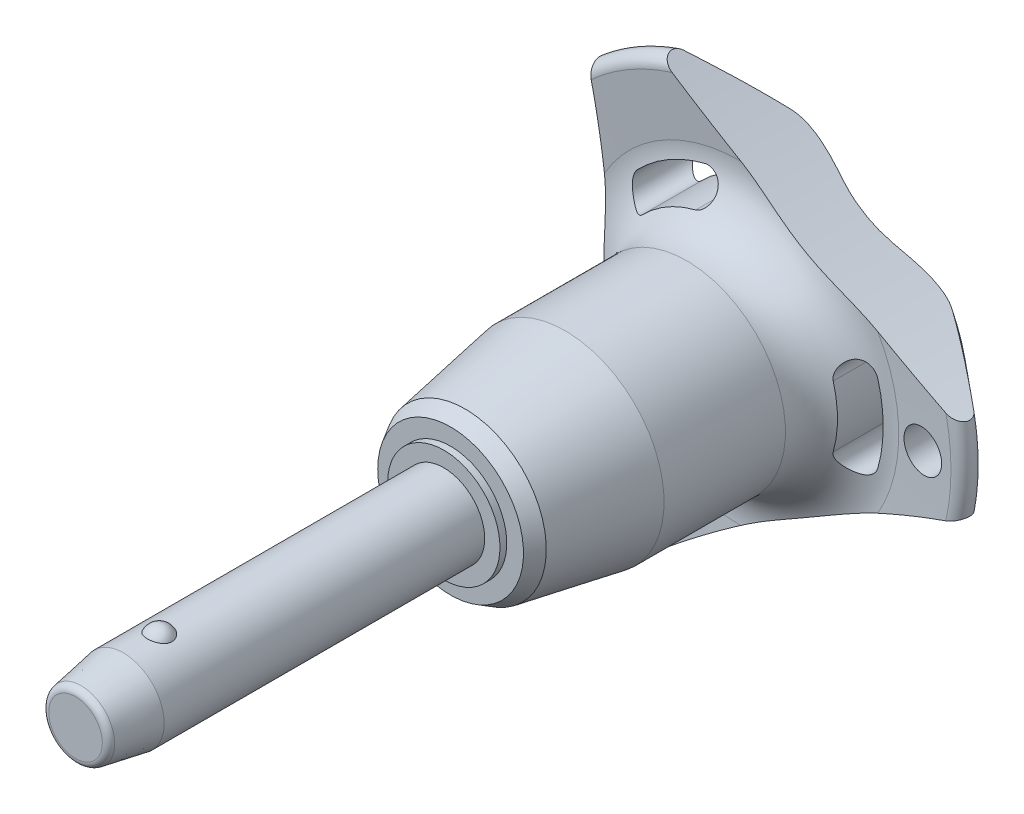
from build123d import *

# Parameters (mm, degrees)
SKETCH1_R           = 3
BOSS_EXTRUDE1_DEPTH = 20
SKETCH2_R           = 2.5
BOSS_EXTRUDE2_DEPTH = 26.7
BOSS_EXTRUDE3_START = 7
SKETCH1_2_R         = 3
BOSS_EXTRUDE3_DEPTH = 7
CHAMFER1_SIZE       = 3.5
CHAMFER1_SIZE2      = 0.617144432
FILLET1_R           = 0.5
SKETCH6_R           = 79.96
CUT_EXTRUDE1_DEPTH  = 53.269297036
CIRPATTERN1_COUNT   = 3
SKETCH7_R           = 1.5
CUT_EXTRUDE2_DEPTH  = 52.977278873


with BuildPart() as part:
    # Sketch1 → Boss-Extrude1 (new body)
    with BuildSketch(Plane.XY):
        Circle(SKETCH1_R)
    extrude(amount=-BOSS_EXTRUDE1_DEPTH)

    # Sketch2 → Boss-Extrude2 (add)
    with BuildSketch(Plane(origin=(0, 0, -20), x_dir=(-1, 0, 0), z_dir=(0, 0, -1))):
        Circle(SKETCH2_R)
    extrude(amount=BOSS_EXTRUDE2_DEPTH)

    # Sketch3 → Revolve1 (revolve)
    with BuildSketch(Plane(origin=(0, 0, 0), x_dir=(0, 0, -1), z_dir=(1, 0, 0))):
        with BuildLine():
            Line((-0.866025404, 3.5), (-0.866025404, 1.5))
            ThreePointArc((-0.866025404, 1.5), (0.133974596, 2.5), (-0.866025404, 3.5))
        make_face()
        with BuildLine():
            Line((-0.866025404, -1.5), (-0.866025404, -3.5))
            ThreePointArc((-0.866025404, -3.5), (0.133974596, -2.5), (-0.866025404, -1.5))
        make_face()
    revolve(axis=Axis((0, -1.5, 0.866025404), (0, 1, 0)))

    # Sketch1_2 → Boss-Extrude3 (add)
    with BuildSketch(Plane.XY.offset(BOSS_EXTRUDE3_START)):
        Circle(SKETCH1_2_R)
    extrude(amount=-BOSS_EXTRUDE3_DEPTH)

    # Chamfer1
    chamfer1_edges = [part.edges().sort_by_distance(p)[0] for p in [
        (-3, 0, 7),
    ]]
    chamfer1_side = [part.faces().sort_by_distance(p)[0] for p in [
        (-3, 0, -6.5),
    ]]
    chamfer(chamfer1_edges, length=CHAMFER1_SIZE, length2=CHAMFER1_SIZE2, reference=chamfer1_side[0])

    # Fillet1
    fillet1_edges = [part.edges().sort_by_distance(p)[0] for p in [
        (-2.382855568, 0, 7),
        (2.5, 0, -46.7),
    ]]
    fillet(fillet1_edges, radius=FILLET1_R)

    # Sketch4 → Revolve2 (revolve)
    with BuildSketch(Plane(origin=(0, 0, 0), x_dir=(0, 0, -1), z_dir=(1, 0, 0)), mode=Mode.PRIVATE) as revolve2_sk:
        Polygon((20, 0), (20, 4.118359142), (20.5, 4.118359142), (20.5, 5.343400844), (21.560917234, 5.955921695), (28.9, 7.25), (37.8, 7.25), (37.8, 0), align=None)
    revolve(revolve2_sk.sketch.rotate(Axis((0, 0, -37.8), (0, 0, 1)), 90), axis=Axis((0, 0, -37.8), (0, 0, 1)))

    # Sketch5 → Revolve3 (revolve)
    with BuildSketch(Plane(origin=(0, 0, 0), x_dir=(0, 0, -1), z_dir=(1, 0, 0)), mode=Mode.PRIVATE) as revolve3_sk:
        with BuildLine():
            Line((41.78715932, 11.570250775), (41.452568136, 15.735949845))
            ThreePointArc((41.452568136, 15.735949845), (41.946485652, 16.540188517), (42.862835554, 16.314230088))
            Line((42.862835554, 16.314230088), (46.326414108, 12.186497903))
            ThreePointArc((46.326414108, 12.186497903), (46.7, 11.109282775), (46.261488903, 10.056825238))
            ThreePointArc((46.261488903, 10.056825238), (43.289873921, 5.413681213), (42.25, 0))
            Line((42.25, 0), (37.8, 0))
            Line((37.8, 0), (37.8, 7.25))
            ThreePointArc((37.8, 7.25), (40.739473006, 8.537160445), (41.78715932, 11.570250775))
        make_face()
    revolve(revolve3_sk.sketch.rotate(Axis((0, 0, -42.25), (0, 0, 1)), 90), axis=Axis((0, 0, -42.25), (0, 0, 1)))

    # Sketch6 → Cut-Extrude1 (cut, through all)
    with BuildSketch(Plane.XY):
        with Locations((-89.76, 0)):
            Circle(SKETCH6_R)
        with BuildLine():
            ThreePointArc((10.099921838, -2.834717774), (10.490188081, 0), (10.099921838, 2.834717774))
            ThreePointArc((10.099921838, 2.834717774), (8.768180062, 3.582738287), (8.020159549, 2.250996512))
            ThreePointArc((8.020159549, 2.250996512), (8.330062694, 0), (8.020159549, -2.250996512))
            ThreePointArc((8.020159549, -2.250996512), (8.768180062, -3.582738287), (10.099921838, -2.834717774))
        make_face()
    cut_extrude1 = extrude(amount=-CUT_EXTRUDE1_DEPTH, mode=Mode.SUBTRACT)

    # CirPattern1: Cut-Extrude1 ×3 about axis
    cirpattern1_axis = Axis((0, 0, 0), (0, 0, 1))
    for i in range(1, CIRPATTERN1_COUNT):
        add(cut_extrude1.rotate(cirpattern1_axis, i * 360 / CIRPATTERN1_COUNT), mode=Mode.SUBTRACT)

    # Sketch7 → Cut-Extrude2 (cut, through all)
    with BuildSketch(Plane.XY):
        with Locations(Location((13.490188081, 0, 0), (0, 0, 225.221865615))):
            Circle(SKETCH7_R)
    extrude(amount=-CUT_EXTRUDE2_DEPTH, mode=Mode.SUBTRACT)


solid = part.part
